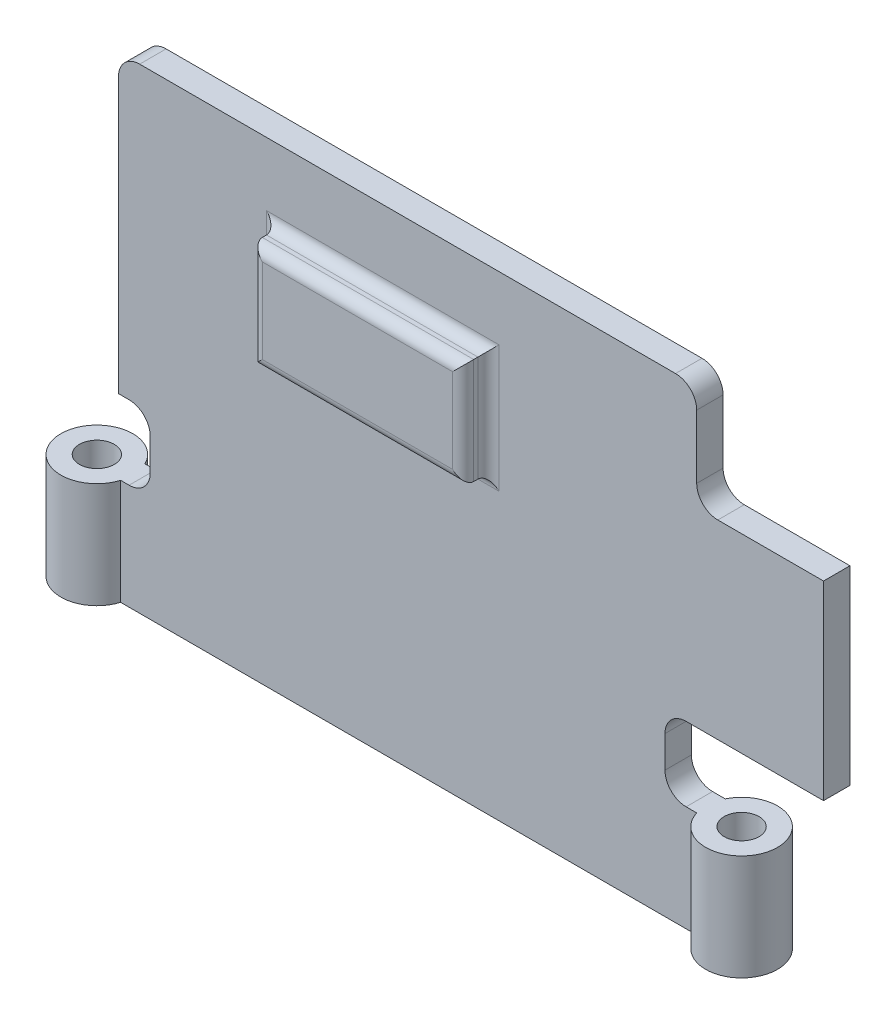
from build123d import *

# Parameters (mm, degrees)
ESQUISSE1_R             = 1.65
BOSS_EXTRU_1_DEPTH      = 10
ESQUISSE2_W             = 54.699155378
ESQUISSE2_H             = 2.5
BOSS_EXTRU_2_DEPTH      = 35
ESQUISSE3_W             = 2.5
ESQUISSE3_H             = 7
ENL_V_MAT_EXTRU_1_DEPTH = 3
ESQUISSE4_W             = 2.5
ESQUISSE4_H             = 7
ENL_V_MAT_EXTRU_2_DEPTH = 3
ESQUISSE5_W             = 2.5
ESQUISSE5_H             = 18
BOSS_EXTRU_3_DEPTH      = 12
ESQUISSE7_W             = 20
ESQUISSE7_H             = 10
BOSS_EXTRU_4_DEPTH      = 2.4
CONG_1_R                = 2
CONG_2_R                = 1
BOSS_EXTRU_5_DEPTH      = 1


with BuildPart() as part:
    # Esquisse1 → Boss.-Extru.1 (new body)
    with BuildSketch(Plane(origin=(0, 0, 0), x_dir=(1, 0, 0), z_dir=(0, 1, 0))):
        with BuildLine():
            Line((-27.44877074, 1.5), (27.44877074, 1.5))
            ThreePointArc((27.44877074, 1.5), (33.889345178, -0.26895959), (27.250384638, -1))
            Line((27.250384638, -1), (-27.250384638, -1))
            ThreePointArc((-27.250384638, -1), (-33.889345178, -0.26895959), (-27.44877074, 1.5))
        make_face()
        with Locations(Location((-30.5, 0, 0), (0, 0, 270))):
            Circle(ESQUISSE1_R, mode=Mode.SUBTRACT)
        with Locations(Location((30.5, 0, 0), (0, 0, 270))):
            Circle(ESQUISSE1_R, mode=Mode.SUBTRACT)
    extrude(amount=BOSS_EXTRU_1_DEPTH)

    # Esquisse2 → Boss.-Extru.2 (add)
    with BuildSketch(Plane(origin=(0, 10, 0), x_dir=(1, 0, 0), z_dir=(0, 1, 0))):
        with Locations((-0.099193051, 0.25)):
            Rectangle(ESQUISSE2_W, ESQUISSE2_H)
    extrude(amount=BOSS_EXTRU_2_DEPTH)

    # Esquisse3 → Enl_v. mat.-Extru.1 (cut)
    with BuildSketch(Plane.ZY.offset(27.44877074)):
        with Locations((-0.25, 13.5)):
            Rectangle(ESQUISSE3_W, ESQUISSE3_H)
    extrude(amount=-ENL_V_MAT_EXTRU_1_DEPTH, mode=Mode.SUBTRACT)

    # Esquisse4 → Enl_v. mat.-Extru.2 (cut)
    with BuildSketch(Plane(origin=(27.250384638, 0, 0), x_dir=(0, 0, -1), z_dir=(1, 0, 0))):
        with Locations((0.25, 13.5)):
            Rectangle(ESQUISSE4_W, ESQUISSE4_H)
    extrude(amount=-ENL_V_MAT_EXTRU_2_DEPTH, mode=Mode.SUBTRACT)

    # Esquisse5 → Boss.-Extru.3 (add)
    with BuildSketch(Plane(origin=(27.250384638, 0, 0), x_dir=(0, 0, -1), z_dir=(1, 0, 0))):
        with Locations((0.25, 26)):
            Rectangle(ESQUISSE5_W, ESQUISSE5_H)
    extrude(amount=BOSS_EXTRU_3_DEPTH)

    # Esquisse7 → Boss.-Extru.4 (add)
    with BuildSketch(Plane.XY.offset(1)):
        with Locations((-2.44877074, 33)):
            Rectangle(ESQUISSE7_W, ESQUISSE7_H)
    extrude(amount=BOSS_EXTRU_4_DEPTH)

    # Cong_1
    cong_1_edges = [part.edges().sort_by_distance(p)[0] for p in [
        (-27.44877074, 45, -0.25),
        (27.250384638, 45, -0.25),
        (-24.44877074, 17, -0.25),
        (-24.44877074, 10, -0.25),
        (24.250384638, 10, -0.25),
        (24.250384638, 17, -0.25),
        (27.250384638, 35, -0.25),
    ]]
    fillet(cong_1_edges, radius=CONG_1_R)

    # Cong_2
    cong_2_edges = [part.edges().sort_by_distance(p)[0] for p in [
        (7.55122926, 33, 1),
        (-2.44877074, 38, 1),
        (-12.44877074, 33, 1),
        (-2.44877074, 28, 1),
        (7.55122926, 33, 3.4),
        (-2.44877074, 38, 3.4),
        (-12.44877074, 33, 3.4),
        (-2.44877074, 28, 3.4),
    ]]
    fillet(cong_2_edges, radius=CONG_2_R)

    # Esquisse8 → Boss.-Extru.5 (add)
    with BuildSketch(Plane(origin=(0, 0, -1.5), x_dir=(-1, 0, 0), z_dir=(0, 0, -1))):
        Polygon((-24.5, 28), (-24.5, 21), (-22.582256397, 21), (-22.582256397, 26), (-5.582256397, 26), (-5.582256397, 28), align=None)
    extrude(amount=BOSS_EXTRU_5_DEPTH)


solid = part.part
